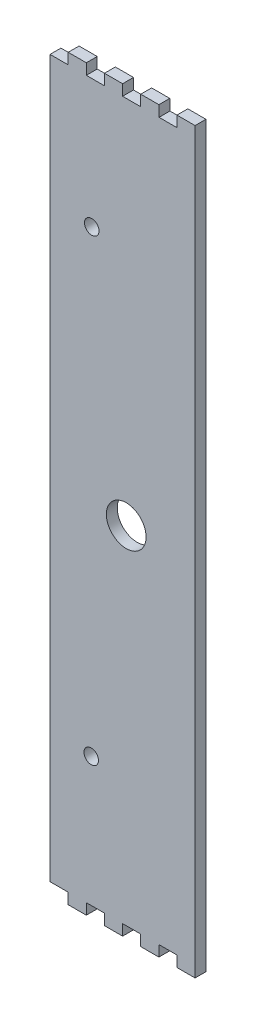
from build123d import *

# Parameters (mm, degrees)
ESTRUSIONE_ESTRUSIONE1_DEPTH = 6
SKETCH1_R                    = 4
CUT_EXTRUDE1_DEPTH           = 6
SKETCH3_R                    = 10.95
CUT_EXTRUDE3_DEPTH           = 10
SKETCH4_R                    = 4
CUT_EXTRUDE4_DEPTH           = 6


with BuildPart() as part:
    # Schizzo1 → Estrusione-Estrusione1 (new body)
    with BuildSketch(Plane.XY):
        Polygon((-40, 110), (-40, -285), (-30, -285), (-30, -291), (-20, -291), (-20, -285), (-10, -285), (-10, -291), (0, -291), (0, -285), (10, -285), (10, -291), (20, -291), (20, -285), (30, -285), (29.95, -291), (39.95, -291), (39.95, 116), (29.95, 116), (30.1, 110), (20.1, 110), (20, 116), (10, 116), (10, 110), (0, 110), (0, 116), (-10, 116), (-10, 110), (-20, 110), (-20, 116), (-30, 116), (-30, 110), align=None)
    extrude(amount=ESTRUSIONE_ESTRUSIONE1_DEPTH)

    # Sketch1 → Cut-Extrude1 (cut)
    with BuildSketch(Plane(origin=(-51.885753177, -233.545283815, 6), x_dir=(0, 1, 0), z_dir=(0, 0, 1))):
        with Locations(Location((19.745283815, -34.585753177, 0), (0, 0, 270))):
            Circle(SKETCH1_R)
    extrude(amount=-CUT_EXTRUDE1_DEPTH, mode=Mode.SUBTRACT)

    # Sketch3 → Cut-Extrude3 (cut)
    with BuildSketch(Plane(origin=(-51.885753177, 58.545283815, 6), x_dir=(0, 1, 0), z_dir=(0, 0, 1))):
        with Locations(Location((-152.545283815, -53.885753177, 0), (0, 0, 270))):
            Circle(SKETCH3_R)
    extrude(amount=-CUT_EXTRUDE3_DEPTH, mode=Mode.SUBTRACT)

    # Sketch4 → Cut-Extrude4 (cut)
    with BuildSketch(Plane(origin=(-51.885753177, -233.545283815, 6), x_dir=(0, 1, 0), z_dir=(0, 0, 1))):
        with Locations(Location((272.678572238, -34.878007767, 0), (0, 0, 270))):
            Circle(SKETCH4_R)
    extrude(amount=-CUT_EXTRUDE4_DEPTH, mode=Mode.SUBTRACT)


solid = part.part
